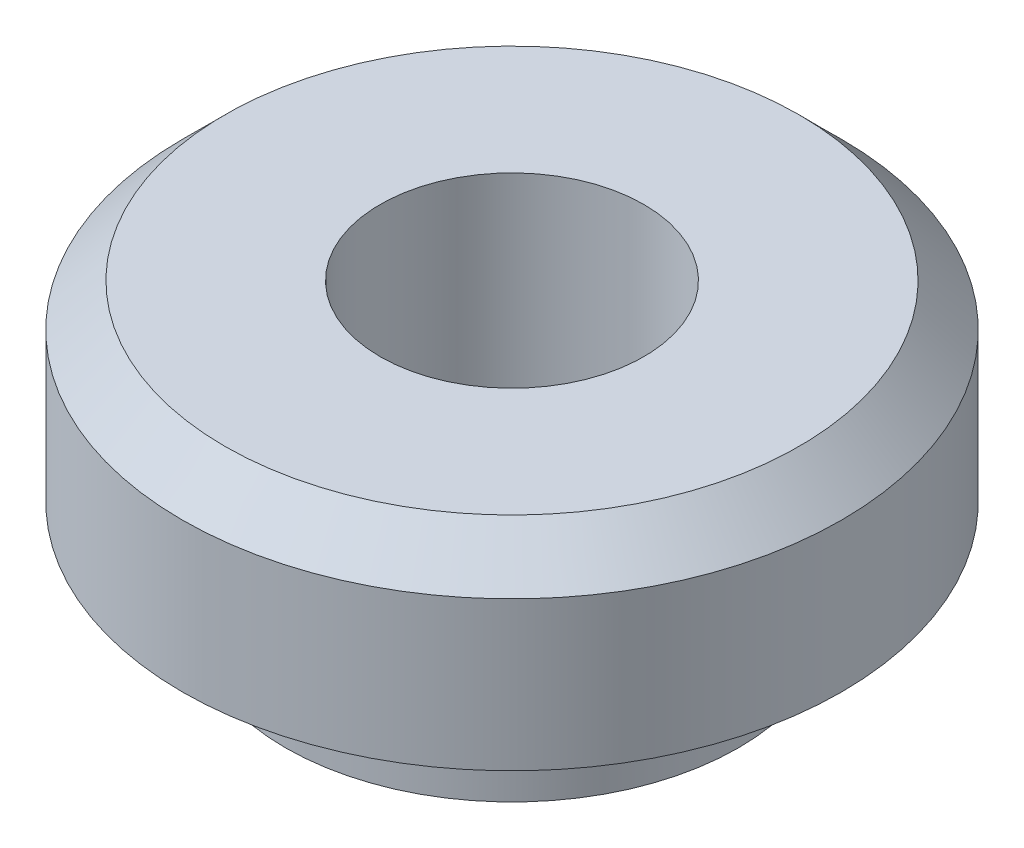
from build123d import *


with BuildPart() as part:
    # Sketch1 → Base-Revolve (revolve)
    with BuildSketch(Plane(origin=(0, 0, 0), x_dir=(0, 0, -1), z_dir=(1, 0, 0))):
        Polygon((-1.5748, -1.1938), (-1.5748, 2.286), (-3.429, 2.286), (-3.937, 1.778), (-3.937, 0), (-2.7051, 0), (-2.7051, -1.1938), align=None)
    revolve(axis=Axis((0, 2.54, 0), (0, -1, 0)))


solid = part.part
